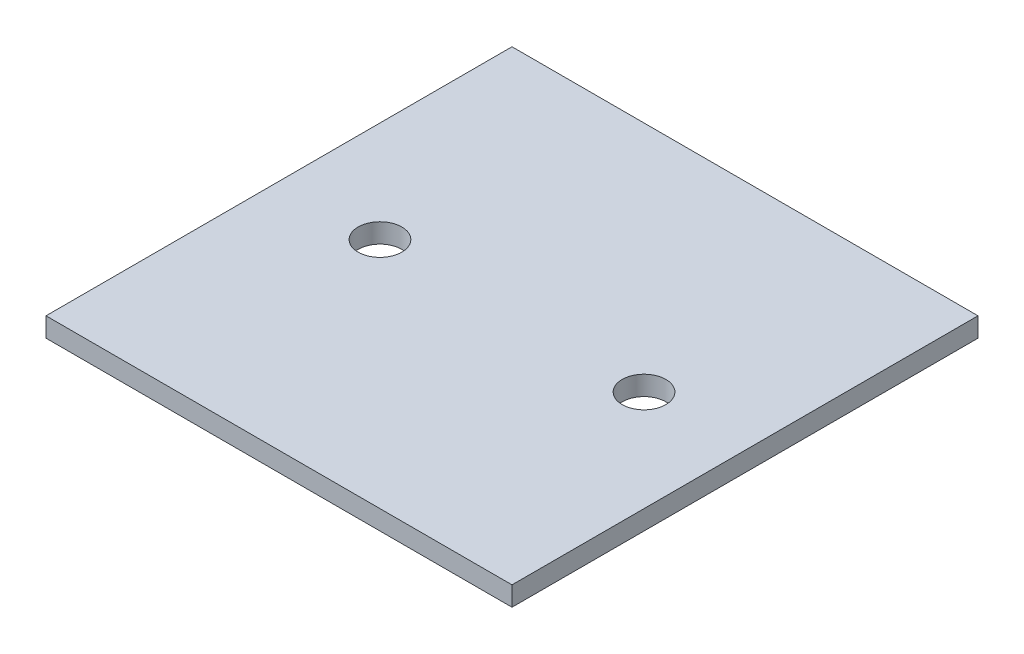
ISO-10303-21;
HEADER;
FILE_DESCRIPTION(('STEP AP214'),'2;1');
FILE_NAME('part.step','',(''),(''),'','','');
FILE_SCHEMA(('AUTOMOTIVE_DESIGN { 1 0 10303 214 1 1 1 1 }'));
ENDSEC;
DATA;
#1=APPLICATION_CONTEXT('core data for automotive mechanical design processes');
#2=APPLICATION_PROTOCOL_DEFINITION('international standard','automotive_design',2000,#1);
#3=PRODUCT_CONTEXT('',#1,'mechanical');
#4=PRODUCT('Part','Part','',(#3));
#5=PRODUCT_RELATED_PRODUCT_CATEGORY('part','',(#4));
#6=PRODUCT_DEFINITION_FORMATION('','',#4);
#7=PRODUCT_DEFINITION_CONTEXT('part definition',#1,'design');
#8=PRODUCT_DEFINITION('design','',#6,#7);
#9=PRODUCT_DEFINITION_SHAPE('','',#8);
#10=(LENGTH_UNIT() NAMED_UNIT(*) SI_UNIT(.MILLI.,.METRE.));
#11=(NAMED_UNIT(*) PLANE_ANGLE_UNIT() SI_UNIT($,.RADIAN.));
#12=(NAMED_UNIT(*) SI_UNIT($,.STERADIAN.) SOLID_ANGLE_UNIT());
#13=UNCERTAINTY_MEASURE_WITH_UNIT(LENGTH_MEASURE(1.E-05),#10,'distance_accuracy_value','');
#14=(GEOMETRIC_REPRESENTATION_CONTEXT(3) GLOBAL_UNCERTAINTY_ASSIGNED_CONTEXT((#13)) GLOBAL_UNIT_ASSIGNED_CONTEXT((#10,
#11,#12)) REPRESENTATION_CONTEXT('',''));
#15=CARTESIAN_POINT('',(0.,0.,0.));
#16=DIRECTION('',(0.,0.,1.));
#17=DIRECTION('',(1.,0.,0.));
#18=AXIS2_PLACEMENT_3D('',#15,#16,#17);
#19=CARTESIAN_POINT('',(-76.2,6.35,-76.2));
#20=DIRECTION('',(1.,0.,0.));
#21=DIRECTION('',(0.,0.,-1.));
#22=AXIS2_PLACEMENT_3D('',#19,#20,#21);
#23=PLANE('',#22);
#24=DIRECTION('',(0.,0.,1.));
#25=VECTOR('',#24,1.);
#26=CARTESIAN_POINT('',(-76.2,0.,-76.2));
#27=LINE('',#26,#25);
#28=CARTESIAN_POINT('',(-76.2,0.,-76.2));
#29=VERTEX_POINT('',#28);
#30=CARTESIAN_POINT('',(-76.2,0.,76.2));
#31=VERTEX_POINT('',#30);
#32=EDGE_CURVE('E98',#29,#31,#27,.T.);
#33=ORIENTED_EDGE('',*,*,#32,.T.);
#34=DIRECTION('',(0.,-1.,0.));
#35=VECTOR('',#34,1.);
#36=CARTESIAN_POINT('',(-76.2,6.35,76.2));
#37=LINE('',#36,#35);
#38=CARTESIAN_POINT('',(-76.2,6.35,76.2));
#39=VERTEX_POINT('',#38);
#40=EDGE_CURVE('E11',#39,#31,#37,.T.);
#41=ORIENTED_EDGE('',*,*,#40,.F.);
#42=DIRECTION('',(0.,0.,1.));
#43=VECTOR('',#42,1.);
#44=CARTESIAN_POINT('',(-76.2,6.35,-76.2));
#45=LINE('',#44,#43);
#46=CARTESIAN_POINT('',(-76.2,6.35,-76.2));
#47=VERTEX_POINT('',#46);
#48=EDGE_CURVE('E86',#47,#39,#45,.T.);
#49=ORIENTED_EDGE('',*,*,#48,.F.);
#50=DIRECTION('',(0.,-1.,0.));
#51=VECTOR('',#50,1.);
#52=CARTESIAN_POINT('',(-76.2,6.35,-76.2));
#53=LINE('',#52,#51);
#54=EDGE_CURVE('E94',#47,#29,#53,.T.);
#55=ORIENTED_EDGE('',*,*,#54,.T.);
#56=EDGE_LOOP('',(#33,#41,#49,#55));
#57=FACE_BOUND('',#56,.T.);
#58=ADVANCED_FACE('F35',(#57),#23,.F.);
#59=CARTESIAN_POINT('',(-76.2,6.35,76.2));
#60=DIRECTION('',(0.,0.,-1.));
#61=DIRECTION('',(-1.,0.,0.));
#62=AXIS2_PLACEMENT_3D('',#59,#60,#61);
#63=PLANE('',#62);
#64=DIRECTION('',(1.,0.,0.));
#65=VECTOR('',#64,1.);
#66=CARTESIAN_POINT('',(-76.2,0.,76.2));
#67=LINE('',#66,#65);
#68=CARTESIAN_POINT('',(76.2,0.,76.2));
#69=VERTEX_POINT('',#68);
#70=EDGE_CURVE('E90',#31,#69,#67,.T.);
#71=ORIENTED_EDGE('',*,*,#70,.T.);
#72=DIRECTION('',(0.,-1.,0.));
#73=VECTOR('',#72,1.);
#74=CARTESIAN_POINT('',(76.2,6.35,76.2));
#75=LINE('',#74,#73);
#76=CARTESIAN_POINT('',(76.2,6.35,76.2));
#77=VERTEX_POINT('',#76);
#78=EDGE_CURVE('E43',#77,#69,#75,.T.);
#79=ORIENTED_EDGE('',*,*,#78,.F.);
#80=DIRECTION('',(1.,0.,0.));
#81=VECTOR('',#80,1.);
#82=CARTESIAN_POINT('',(-76.2,6.35,76.2));
#83=LINE('',#82,#81);
#84=EDGE_CURVE('E81',#39,#77,#83,.T.);
#85=ORIENTED_EDGE('',*,*,#84,.F.);
#86=ORIENTED_EDGE('',*,*,#40,.T.);
#87=EDGE_LOOP('',(#71,#79,#85,#86));
#88=FACE_BOUND('',#87,.T.);
#89=ADVANCED_FACE('F89',(#88),#63,.F.);
#90=CARTESIAN_POINT('',(76.2,6.35,-76.2));
#91=DIRECTION('',(-1.,0.,0.));
#92=DIRECTION('',(0.,0.,1.));
#93=AXIS2_PLACEMENT_3D('',#90,#91,#92);
#94=PLANE('',#93);
#95=DIRECTION('',(0.,0.,-1.));
#96=VECTOR('',#95,1.);
#97=CARTESIAN_POINT('',(76.2,0.,-76.2));
#98=LINE('',#97,#96);
#99=CARTESIAN_POINT('',(76.2,0.,-76.2));
#100=VERTEX_POINT('',#99);
#101=EDGE_CURVE('E68',#69,#100,#98,.T.);
#102=ORIENTED_EDGE('',*,*,#101,.T.);
#103=DIRECTION('',(0.,-1.,0.));
#104=VECTOR('',#103,1.);
#105=CARTESIAN_POINT('',(76.2,6.35,-76.2));
#106=LINE('',#105,#104);
#107=CARTESIAN_POINT('',(76.2,6.35,-76.2));
#108=VERTEX_POINT('',#107);
#109=EDGE_CURVE('E91',#108,#100,#106,.T.);
#110=ORIENTED_EDGE('',*,*,#109,.F.);
#111=DIRECTION('',(0.,0.,-1.));
#112=VECTOR('',#111,1.);
#113=CARTESIAN_POINT('',(76.2,6.35,-76.2));
#114=LINE('',#113,#112);
#115=EDGE_CURVE('E84',#77,#108,#114,.T.);
#116=ORIENTED_EDGE('',*,*,#115,.F.);
#117=ORIENTED_EDGE('',*,*,#78,.T.);
#118=EDGE_LOOP('',(#102,#110,#116,#117));
#119=FACE_BOUND('',#118,.T.);
#120=ADVANCED_FACE('F92',(#119),#94,.F.);
#121=CARTESIAN_POINT('',(-76.2,6.35,-76.2));
#122=DIRECTION('',(0.,0.,1.));
#123=DIRECTION('',(1.,0.,0.));
#124=AXIS2_PLACEMENT_3D('',#121,#122,#123);
#125=PLANE('',#124);
#126=DIRECTION('',(-1.,0.,0.));
#127=VECTOR('',#126,1.);
#128=CARTESIAN_POINT('',(-76.2,0.,-76.2));
#129=LINE('',#128,#127);
#130=EDGE_CURVE('E74',#100,#29,#129,.T.);
#131=ORIENTED_EDGE('',*,*,#130,.T.);
#132=ORIENTED_EDGE('',*,*,#54,.F.);
#133=DIRECTION('',(-1.,0.,0.));
#134=VECTOR('',#133,1.);
#135=CARTESIAN_POINT('',(-76.2,6.35,-76.2));
#136=LINE('',#135,#134);
#137=EDGE_CURVE('E51',#108,#47,#136,.T.);
#138=ORIENTED_EDGE('',*,*,#137,.F.);
#139=ORIENTED_EDGE('',*,*,#109,.T.);
#140=EDGE_LOOP('',(#131,#132,#138,#139));
#141=FACE_BOUND('',#140,.T.);
#142=ADVANCED_FACE('F106',(#141),#125,.F.);
#143=CARTESIAN_POINT('',(0.,6.35,0.));
#144=DIRECTION('',(0.,1.,0.));
#145=DIRECTION('',(0.,0.,1.));
#146=AXIS2_PLACEMENT_3D('',#143,#144,#145);
#147=PLANE('',#146);
#148=CARTESIAN_POINT('',(-43.18,6.35,0.));
#149=DIRECTION('',(0.,1.,0.));
#150=DIRECTION('',(0.,0.,1.));
#151=AXIS2_PLACEMENT_3D('',#148,#149,#150);
#152=CIRCLE('',#151,7.14375);
#153=CARTESIAN_POINT('',(-43.18,6.35,7.14375));
#154=VERTEX_POINT('',#153);
#155=EDGE_CURVE('E101',#154,#154,#152,.F.);
#156=ORIENTED_EDGE('',*,*,#155,.T.);
#157=EDGE_LOOP('',(#156));
#158=FACE_BOUND('',#157,.T.);
#159=CARTESIAN_POINT('',(43.18,6.35,0.));
#160=DIRECTION('',(0.,1.,0.));
#161=DIRECTION('',(0.,0.,1.));
#162=AXIS2_PLACEMENT_3D('',#159,#160,#161);
#163=CIRCLE('',#162,7.14375);
#164=CARTESIAN_POINT('',(43.18,6.35,7.14375));
#165=VERTEX_POINT('',#164);
#166=EDGE_CURVE('E114',#165,#165,#163,.F.);
#167=ORIENTED_EDGE('',*,*,#166,.T.);
#168=EDGE_LOOP('',(#167));
#169=FACE_BOUND('',#168,.T.);
#170=ORIENTED_EDGE('',*,*,#48,.T.);
#171=ORIENTED_EDGE('',*,*,#84,.T.);
#172=ORIENTED_EDGE('',*,*,#115,.T.);
#173=ORIENTED_EDGE('',*,*,#137,.T.);
#174=EDGE_LOOP('',(#170,#171,#172,#173));
#175=FACE_BOUND('',#174,.T.);
#176=ADVANCED_FACE('F82',(#158,#169,#175),#147,.T.);
#177=CARTESIAN_POINT('',(0.,0.,0.));
#178=DIRECTION('',(0.,1.,0.));
#179=DIRECTION('',(0.,0.,1.));
#180=AXIS2_PLACEMENT_3D('',#177,#178,#179);
#181=PLANE('',#180);
#182=CARTESIAN_POINT('',(-43.18,0.,0.));
#183=DIRECTION('',(0.,1.,0.));
#184=DIRECTION('',(0.,0.,1.));
#185=AXIS2_PLACEMENT_3D('',#182,#183,#184);
#186=CIRCLE('',#185,7.14375);
#187=CARTESIAN_POINT('',(-43.18,0.,7.14375));
#188=VERTEX_POINT('',#187);
#189=EDGE_CURVE('E117',#188,#188,#186,.T.);
#190=ORIENTED_EDGE('',*,*,#189,.T.);
#191=EDGE_LOOP('',(#190));
#192=FACE_BOUND('',#191,.T.);
#193=CARTESIAN_POINT('',(43.18,0.,0.));
#194=DIRECTION('',(0.,1.,0.));
#195=DIRECTION('',(0.,0.,1.));
#196=AXIS2_PLACEMENT_3D('',#193,#194,#195);
#197=CIRCLE('',#196,7.14375);
#198=CARTESIAN_POINT('',(43.18,0.,7.14375));
#199=VERTEX_POINT('',#198);
#200=EDGE_CURVE('E118',#199,#199,#197,.T.);
#201=ORIENTED_EDGE('',*,*,#200,.T.);
#202=EDGE_LOOP('',(#201));
#203=FACE_BOUND('',#202,.T.);
#204=ORIENTED_EDGE('',*,*,#32,.F.);
#205=ORIENTED_EDGE('',*,*,#130,.F.);
#206=ORIENTED_EDGE('',*,*,#101,.F.);
#207=ORIENTED_EDGE('',*,*,#70,.F.);
#208=EDGE_LOOP('',(#204,#205,#206,#207));
#209=FACE_BOUND('',#208,.T.);
#210=ADVANCED_FACE('F109',(#192,#203,#209),#181,.F.);
#211=CARTESIAN_POINT('',(43.18,25.4,0.));
#212=DIRECTION('',(0.,-1.,0.));
#213=DIRECTION('',(0.,0.,-1.));
#214=AXIS2_PLACEMENT_3D('',#211,#212,#213);
#215=CYLINDRICAL_SURFACE('',#214,7.14375);
#216=ORIENTED_EDGE('',*,*,#166,.F.);
#217=EDGE_LOOP('',(#216));
#218=FACE_BOUND('',#217,.T.);
#219=ORIENTED_EDGE('',*,*,#200,.F.);
#220=EDGE_LOOP('',(#219));
#221=FACE_BOUND('',#220,.T.);
#222=ADVANCED_FACE('F128',(#218,#221),#215,.F.);
#223=CARTESIAN_POINT('',(-43.18,25.4,0.));
#224=DIRECTION('',(0.,-1.,0.));
#225=DIRECTION('',(0.,0.,-1.));
#226=AXIS2_PLACEMENT_3D('',#223,#224,#225);
#227=CYLINDRICAL_SURFACE('',#226,7.14375);
#228=ORIENTED_EDGE('',*,*,#155,.F.);
#229=EDGE_LOOP('',(#228));
#230=FACE_BOUND('',#229,.T.);
#231=ORIENTED_EDGE('',*,*,#189,.F.);
#232=EDGE_LOOP('',(#231));
#233=FACE_BOUND('',#232,.T.);
#234=ADVANCED_FACE('F126',(#230,#233),#227,.F.);
#235=CLOSED_SHELL('',(#58,#89,#120,#142,#176,#210,#222,#234));
#236=MANIFOLD_SOLID_BREP('B2',#235);
#237=ADVANCED_BREP_SHAPE_REPRESENTATION('',(#18,#236),#14);
#238=SHAPE_DEFINITION_REPRESENTATION(#9,#237);
ENDSEC;
END-ISO-10303-21;
